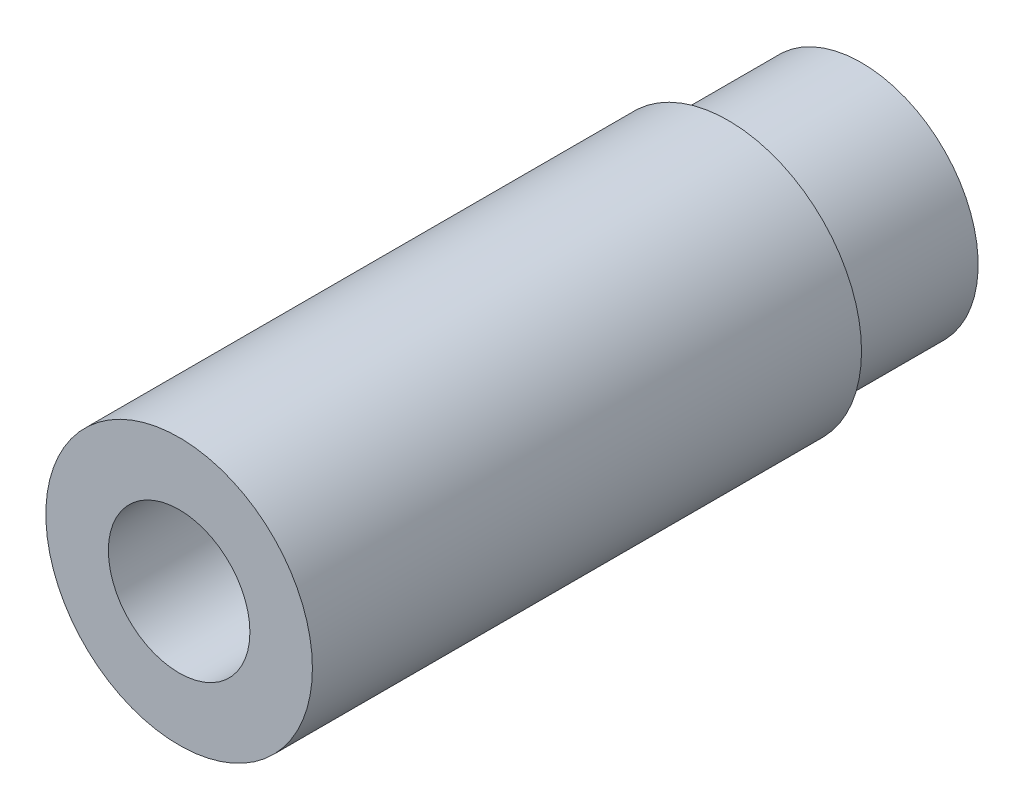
from build123d import *

# Parameters (mm, degrees)
SKETCH1_R           = 12.7
BOSS_EXTRUDE1_DEPTH = 52.324
CUT_EXTRUDE1_REACH  = 57.321
SKETCH2_R           = 6.7437
BOSS_EXTRUDE2_START = 12.7
SKETCH3_R           = 11.1125
SKETCH3_R_2         = 6.7437
BOSS_EXTRUDE2_DEPTH = 12.7


with BuildPart() as part:
    # Sketch1 → Boss-Extrude1 (new body)
    with BuildSketch(Plane.XY):
        Circle(SKETCH1_R)
    extrude(amount=BOSS_EXTRUDE1_DEPTH)

    # Sketch2 → Cut-Extrude1 (cut, up to next)
    with BuildSketch(Plane(origin=(0, 0, 0), x_dir=(-1, 0, 0), z_dir=(0, 0, -1)), mode=Mode.PRIVATE) as cut_extrude1_sk1:
        Circle(SKETCH2_R)
    cut_extrude1_tool1 = extrude(cut_extrude1_sk1.sketch, amount=-CUT_EXTRUDE1_REACH, mode=Mode.PRIVATE) & part.part
    add(cut_extrude1_tool1.solids().sort_by_distance((0, 0, 0))[0], mode=Mode.SUBTRACT)

    # Sketch3 → Boss-Extrude2 (add)
    with BuildSketch(Plane(origin=(0, 0, 0), x_dir=(-1, 0, 0), z_dir=(0, 0, -1)).offset(BOSS_EXTRUDE2_START)):
        Circle(SKETCH3_R)
        Circle(SKETCH3_R_2, mode=Mode.SUBTRACT)
    extrude(amount=-BOSS_EXTRUDE2_DEPTH)


solid = part.part
